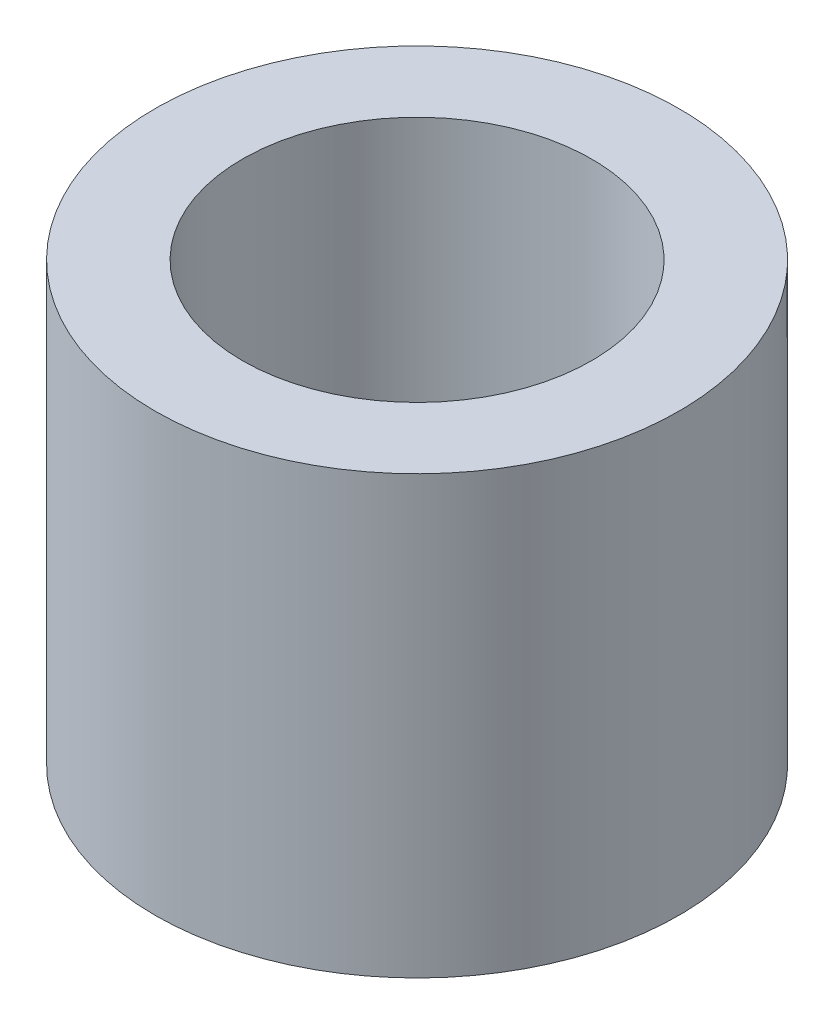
ISO-10303-21;
HEADER;
FILE_DESCRIPTION(('STEP AP214'),'2;1');
FILE_NAME('part.step','',(''),(''),'','','');
FILE_SCHEMA(('AUTOMOTIVE_DESIGN { 1 0 10303 214 1 1 1 1 }'));
ENDSEC;
DATA;
#1=APPLICATION_CONTEXT('core data for automotive mechanical design processes');
#2=APPLICATION_PROTOCOL_DEFINITION('international standard','automotive_design',2000,#1);
#3=PRODUCT_CONTEXT('',#1,'mechanical');
#4=PRODUCT('Part','Part','',(#3));
#5=PRODUCT_RELATED_PRODUCT_CATEGORY('part','',(#4));
#6=PRODUCT_DEFINITION_FORMATION('','',#4);
#7=PRODUCT_DEFINITION_CONTEXT('part definition',#1,'design');
#8=PRODUCT_DEFINITION('design','',#6,#7);
#9=PRODUCT_DEFINITION_SHAPE('','',#8);
#10=(LENGTH_UNIT() NAMED_UNIT(*) SI_UNIT(.MILLI.,.METRE.));
#11=(NAMED_UNIT(*) PLANE_ANGLE_UNIT() SI_UNIT($,.RADIAN.));
#12=(NAMED_UNIT(*) SI_UNIT($,.STERADIAN.) SOLID_ANGLE_UNIT());
#13=UNCERTAINTY_MEASURE_WITH_UNIT(LENGTH_MEASURE(1.E-05),#10,'distance_accuracy_value','');
#14=(GEOMETRIC_REPRESENTATION_CONTEXT(3) GLOBAL_UNCERTAINTY_ASSIGNED_CONTEXT((#13)) GLOBAL_UNIT_ASSIGNED_CONTEXT((#10,
#11,#12)) REPRESENTATION_CONTEXT('',''));
#15=CARTESIAN_POINT('',(0.,0.,0.));
#16=DIRECTION('',(0.,0.,1.));
#17=DIRECTION('',(1.,0.,0.));
#18=AXIS2_PLACEMENT_3D('',#15,#16,#17);
#19=CARTESIAN_POINT('',(0.,2.5,0.));
#20=DIRECTION('',(0.,1.,0.));
#21=DIRECTION('',(0.,0.,1.));
#22=AXIS2_PLACEMENT_3D('',#19,#20,#21);
#23=PLANE('',#22);
#24=CARTESIAN_POINT('',(0.,2.5,0.));
#25=DIRECTION('',(0.,1.,0.));
#26=DIRECTION('',(0.,0.,1.));
#27=AXIS2_PLACEMENT_3D('',#24,#25,#26);
#28=CIRCLE('',#27,1.5);
#29=CARTESIAN_POINT('',(0.,2.5,1.5));
#30=VERTEX_POINT('',#29);
#31=EDGE_CURVE('E10',#30,#30,#28,.T.);
#32=ORIENTED_EDGE('',*,*,#31,.T.);
#33=EDGE_LOOP('',(#32));
#34=FACE_BOUND('',#33,.T.);
#35=CARTESIAN_POINT('',(0.,2.5,0.));
#36=DIRECTION('',(0.,1.,0.));
#37=DIRECTION('',(0.,0.,1.));
#38=AXIS2_PLACEMENT_3D('',#35,#36,#37);
#39=CIRCLE('',#38,1.);
#40=CARTESIAN_POINT('',(0.,2.5,1.));
#41=VERTEX_POINT('',#40);
#42=EDGE_CURVE('E43',#41,#41,#39,.T.);
#43=ORIENTED_EDGE('',*,*,#42,.F.);
#44=EDGE_LOOP('',(#43));
#45=FACE_BOUND('',#44,.T.);
#46=ADVANCED_FACE('F32',(#34,#45),#23,.T.);
#47=CARTESIAN_POINT('',(0.,0.,0.));
#48=DIRECTION('',(0.,1.,0.));
#49=DIRECTION('',(0.,0.,1.));
#50=AXIS2_PLACEMENT_3D('',#47,#48,#49);
#51=PLANE('',#50);
#52=CARTESIAN_POINT('',(0.,0.,0.));
#53=DIRECTION('',(0.,1.,0.));
#54=DIRECTION('',(0.,0.,1.));
#55=AXIS2_PLACEMENT_3D('',#52,#53,#54);
#56=CIRCLE('',#55,1.5);
#57=CARTESIAN_POINT('',(0.,0.,1.5));
#58=VERTEX_POINT('',#57);
#59=EDGE_CURVE('E36',#58,#58,#56,.T.);
#60=ORIENTED_EDGE('',*,*,#59,.F.);
#61=EDGE_LOOP('',(#60));
#62=FACE_BOUND('',#61,.T.);
#63=CARTESIAN_POINT('',(0.,0.,0.));
#64=DIRECTION('',(0.,1.,0.));
#65=DIRECTION('',(0.,0.,1.));
#66=AXIS2_PLACEMENT_3D('',#63,#64,#65);
#67=CIRCLE('',#66,1.);
#68=CARTESIAN_POINT('',(0.,0.,1.));
#69=VERTEX_POINT('',#68);
#70=EDGE_CURVE('E45',#69,#69,#67,.T.);
#71=ORIENTED_EDGE('',*,*,#70,.T.);
#72=EDGE_LOOP('',(#71));
#73=FACE_BOUND('',#72,.T.);
#74=ADVANCED_FACE('F55',(#62,#73),#51,.F.);
#75=CARTESIAN_POINT('',(0.,2.5,0.));
#76=DIRECTION('',(0.,-1.,0.));
#77=DIRECTION('',(0.,0.,-1.));
#78=AXIS2_PLACEMENT_3D('',#75,#76,#77);
#79=CYLINDRICAL_SURFACE('',#78,1.5);
#80=ORIENTED_EDGE('',*,*,#31,.F.);
#81=EDGE_LOOP('',(#80));
#82=FACE_BOUND('',#81,.T.);
#83=ORIENTED_EDGE('',*,*,#59,.T.);
#84=EDGE_LOOP('',(#83));
#85=FACE_BOUND('',#84,.T.);
#86=ADVANCED_FACE('F34',(#82,#85),#79,.T.);
#87=CARTESIAN_POINT('',(0.,2.5,0.));
#88=DIRECTION('',(0.,-1.,0.));
#89=DIRECTION('',(0.,0.,-1.));
#90=AXIS2_PLACEMENT_3D('',#87,#88,#89);
#91=CYLINDRICAL_SURFACE('',#90,1.);
#92=ORIENTED_EDGE('',*,*,#42,.T.);
#93=EDGE_LOOP('',(#92));
#94=FACE_BOUND('',#93,.T.);
#95=ORIENTED_EDGE('',*,*,#70,.F.);
#96=EDGE_LOOP('',(#95));
#97=FACE_BOUND('',#96,.T.);
#98=ADVANCED_FACE('F51',(#94,#97),#91,.F.);
#99=CLOSED_SHELL('',(#46,#74,#86,#98));
#100=MANIFOLD_SOLID_BREP('B2',#99);
#101=ADVANCED_BREP_SHAPE_REPRESENTATION('',(#18,#100),#14);
#102=SHAPE_DEFINITION_REPRESENTATION(#9,#101);
ENDSEC;
END-ISO-10303-21;
